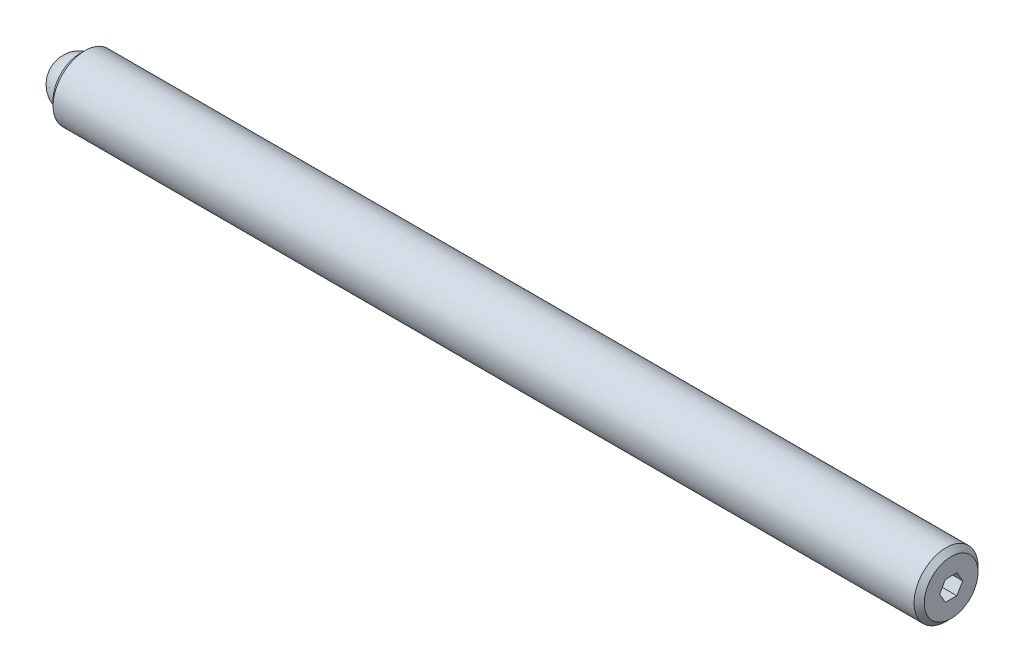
ISO-10303-21;
HEADER;
FILE_DESCRIPTION(('STEP AP214'),'2;1');
FILE_NAME('part.step','',(''),(''),'','','');
FILE_SCHEMA(('AUTOMOTIVE_DESIGN { 1 0 10303 214 1 1 1 1 }'));
ENDSEC;
DATA;
#1=APPLICATION_CONTEXT('core data for automotive mechanical design processes');
#2=APPLICATION_PROTOCOL_DEFINITION('international standard','automotive_design',2000,#1);
#3=PRODUCT_CONTEXT('',#1,'mechanical');
#4=PRODUCT('Part','Part','',(#3));
#5=PRODUCT_RELATED_PRODUCT_CATEGORY('part','',(#4));
#6=PRODUCT_DEFINITION_FORMATION('','',#4);
#7=PRODUCT_DEFINITION_CONTEXT('part definition',#1,'design');
#8=PRODUCT_DEFINITION('design','',#6,#7);
#9=PRODUCT_DEFINITION_SHAPE('','',#8);
#10=(LENGTH_UNIT() NAMED_UNIT(*) SI_UNIT(.MILLI.,.METRE.));
#11=(NAMED_UNIT(*) PLANE_ANGLE_UNIT() SI_UNIT($,.RADIAN.));
#12=(NAMED_UNIT(*) SI_UNIT($,.STERADIAN.) SOLID_ANGLE_UNIT());
#13=UNCERTAINTY_MEASURE_WITH_UNIT(LENGTH_MEASURE(1.E-05),#10,'distance_accuracy_value','');
#14=(GEOMETRIC_REPRESENTATION_CONTEXT(3) GLOBAL_UNCERTAINTY_ASSIGNED_CONTEXT((#13)) GLOBAL_UNIT_ASSIGNED_CONTEXT((#10,
#11,#12)) REPRESENTATION_CONTEXT('',''));
#15=CARTESIAN_POINT('',(0.,0.,0.));
#16=DIRECTION('',(0.,0.,1.));
#17=DIRECTION('',(1.,0.,0.));
#18=AXIS2_PLACEMENT_3D('',#15,#16,#17);
#19=CARTESIAN_POINT('',(0.,0.,0.));
#20=DIRECTION('',(0.,-1.,0.));
#21=DIRECTION('',(0.,0.,1.));
#22=AXIS2_PLACEMENT_3D('',#19,#20,#21);
#23=SPHERICAL_SURFACE('',#22,2.38125);
#24=CARTESIAN_POINT('',(0.,-2.38125,0.));
#25=VERTEX_POINT('',#24);
#26=VERTEX_LOOP('',#25);
#27=FACE_BOUND('',#26,.T.);
#28=ADVANCED_FACE('F43',(#27),#23,.T.);
#29=CLOSED_SHELL('',(#28));
#30=MANIFOLD_SOLID_BREP('B2',#29);
#31=CARTESIAN_POINT('',(86.51875,0.,0.));
#32=DIRECTION('',(-1.,0.,0.));
#33=DIRECTION('',(0.,0.,1.));
#34=AXIS2_PLACEMENT_3D('',#31,#32,#33);
#35=CYLINDRICAL_SURFACE('',#34,3.175);
#36=CARTESIAN_POINT('',(86.01075,0.,0.));
#37=DIRECTION('',(1.,0.,0.));
#38=DIRECTION('',(0.,0.,-1.));
#39=AXIS2_PLACEMENT_3D('',#36,#37,#38);
#40=CIRCLE('',#39,3.175);
#41=CARTESIAN_POINT('',(86.01075,0.,-3.175));
#42=VERTEX_POINT('',#41);
#43=EDGE_CURVE('E41',#42,#42,#40,.F.);
#44=ORIENTED_EDGE('',*,*,#43,.T.);
#45=EDGE_LOOP('',(#44));
#46=FACE_BOUND('',#45,.T.);
#47=CARTESIAN_POINT('',(0.508000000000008,0.,0.));
#48=DIRECTION('',(1.,0.,0.));
#49=DIRECTION('',(0.,0.,-1.));
#50=AXIS2_PLACEMENT_3D('',#47,#48,#49);
#51=CIRCLE('',#50,3.175);
#52=CARTESIAN_POINT('',(0.508000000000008,0.,-3.175));
#53=VERTEX_POINT('',#52);
#54=EDGE_CURVE('E159',#53,#53,#51,.T.);
#55=ORIENTED_EDGE('',*,*,#54,.T.);
#56=EDGE_LOOP('',(#55));
#57=FACE_BOUND('',#56,.T.);
#58=ADVANCED_FACE('F56',(#46,#57),#35,.T.);
#59=CARTESIAN_POINT('',(86.51875,0.,0.));
#60=DIRECTION('',(1.,0.,0.));
#61=DIRECTION('',(0.,0.,-1.));
#62=AXIS2_PLACEMENT_3D('',#59,#60,#61);
#63=PLANE('',#62);
#64=DIRECTION('',(0.,0.866025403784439,-0.5));
#65=VECTOR('',#64,1.);
#66=CARTESIAN_POINT('',(86.51875,-0.9921875,-0.572839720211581));
#67=LINE('',#66,#65);
#68=CARTESIAN_POINT('',(86.51875,-0.9921875,-0.572839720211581));
#69=VERTEX_POINT('',#68);
#70=CARTESIAN_POINT('',(86.51875,0.,-1.14567944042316));
#71=VERTEX_POINT('',#70);
#72=EDGE_CURVE('E71',#69,#71,#67,.T.);
#73=ORIENTED_EDGE('',*,*,#72,.F.);
#74=DIRECTION('',(0.,0.,-1.));
#75=VECTOR('',#74,1.);
#76=CARTESIAN_POINT('',(86.51875,-0.9921875,0.572839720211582));
#77=LINE('',#76,#75);
#78=CARTESIAN_POINT('',(86.51875,-0.9921875,0.572839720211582));
#79=VERTEX_POINT('',#78);
#80=EDGE_CURVE('E155',#79,#69,#77,.T.);
#81=ORIENTED_EDGE('',*,*,#80,.F.);
#82=DIRECTION('',(0.,-0.866025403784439,-0.5));
#83=VECTOR('',#82,1.);
#84=CARTESIAN_POINT('',(86.51875,0.,1.14567944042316));
#85=LINE('',#84,#83);
#86=CARTESIAN_POINT('',(86.51875,0.,1.14567944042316));
#87=VERTEX_POINT('',#86);
#88=EDGE_CURVE('E153',#87,#79,#85,.T.);
#89=ORIENTED_EDGE('',*,*,#88,.F.);
#90=DIRECTION('',(0.,-0.866025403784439,0.5));
#91=VECTOR('',#90,1.);
#92=CARTESIAN_POINT('',(86.51875,0.992187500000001,0.572839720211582));
#93=LINE('',#92,#91);
#94=CARTESIAN_POINT('',(86.51875,0.992187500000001,0.572839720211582));
#95=VERTEX_POINT('',#94);
#96=EDGE_CURVE('E119',#95,#87,#93,.T.);
#97=ORIENTED_EDGE('',*,*,#96,.F.);
#98=DIRECTION('',(0.,0.,1.));
#99=VECTOR('',#98,1.);
#100=CARTESIAN_POINT('',(86.51875,0.9921875,-0.572839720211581));
#101=LINE('',#100,#99);
#102=CARTESIAN_POINT('',(86.51875,0.9921875,-0.572839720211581));
#103=VERTEX_POINT('',#102);
#104=EDGE_CURVE('E149',#103,#95,#101,.T.);
#105=ORIENTED_EDGE('',*,*,#104,.F.);
#106=DIRECTION('',(0.,0.866025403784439,0.5));
#107=VECTOR('',#106,1.);
#108=CARTESIAN_POINT('',(86.51875,0.,-1.14567944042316));
#109=LINE('',#108,#107);
#110=EDGE_CURVE('E145',#71,#103,#109,.T.);
#111=ORIENTED_EDGE('',*,*,#110,.F.);
#112=EDGE_LOOP('',(#73,#81,#89,#97,#105,#111));
#113=FACE_BOUND('',#112,.T.);
#114=CARTESIAN_POINT('',(86.51875,0.,0.));
#115=DIRECTION('',(1.,0.,0.));
#116=DIRECTION('',(0.,0.,-1.));
#117=AXIS2_PLACEMENT_3D('',#114,#115,#116);
#118=CIRCLE('',#117,2.667);
#119=CARTESIAN_POINT('',(86.51875,0.,-2.667));
#120=VERTEX_POINT('',#119);
#121=EDGE_CURVE('E64',#120,#120,#118,.T.);
#122=ORIENTED_EDGE('',*,*,#121,.T.);
#123=EDGE_LOOP('',(#122));
#124=FACE_BOUND('',#123,.T.);
#125=ADVANCED_FACE('F172',(#113,#124),#63,.T.);
#126=CARTESIAN_POINT('',(0.,0.,0.));
#127=DIRECTION('',(1.,0.,0.));
#128=DIRECTION('',(0.,0.,-1.));
#129=AXIS2_PLACEMENT_3D('',#126,#127,#128);
#130=PLANE('',#129);
#131=CARTESIAN_POINT('',(0.,0.,0.));
#132=DIRECTION('',(-1.,0.,0.));
#133=DIRECTION('',(0.,0.,1.));
#134=AXIS2_PLACEMENT_3D('',#131,#132,#133);
#135=CIRCLE('',#134,2.38125);
#136=CARTESIAN_POINT('',(0.,0.,2.38125));
#137=VERTEX_POINT('',#136);
#138=EDGE_CURVE('E227',#137,#137,#135,.T.);
#139=ORIENTED_EDGE('',*,*,#138,.F.);
#140=EDGE_LOOP('',(#139));
#141=FACE_BOUND('',#140,.T.);
#142=CARTESIAN_POINT('',(0.,0.,0.));
#143=DIRECTION('',(1.,0.,0.));
#144=DIRECTION('',(0.,0.,-1.));
#145=AXIS2_PLACEMENT_3D('',#142,#143,#144);
#146=CIRCLE('',#145,2.66699999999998);
#147=CARTESIAN_POINT('',(0.,0.,-2.66699999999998));
#148=VERTEX_POINT('',#147);
#149=EDGE_CURVE('E167',#148,#148,#146,.F.);
#150=ORIENTED_EDGE('',*,*,#149,.T.);
#151=EDGE_LOOP('',(#150));
#152=FACE_BOUND('',#151,.T.);
#153=ADVANCED_FACE('F184',(#141,#152),#130,.F.);
#154=CARTESIAN_POINT('',(0.508000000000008,0.,0.));
#155=DIRECTION('',(1.,0.,0.));
#156=DIRECTION('',(0.,0.,-1.));
#157=AXIS2_PLACEMENT_3D('',#154,#155,#156);
#158=CONICAL_SURFACE('',#157,3.175,0.785398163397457);
#159=ORIENTED_EDGE('',*,*,#149,.F.);
#160=EDGE_LOOP('',(#159));
#161=FACE_BOUND('',#160,.T.);
#162=ORIENTED_EDGE('',*,*,#54,.F.);
#163=EDGE_LOOP('',(#162));
#164=FACE_BOUND('',#163,.T.);
#165=ADVANCED_FACE('F176',(#161,#164),#158,.T.);
#166=CARTESIAN_POINT('',(86.51875,0.,0.));
#167=DIRECTION('',(-1.,0.,0.));
#168=DIRECTION('',(0.,0.,1.));
#169=AXIS2_PLACEMENT_3D('',#166,#167,#168);
#170=CONICAL_SURFACE('',#169,2.667,0.785398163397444);
#171=ORIENTED_EDGE('',*,*,#43,.F.);
#172=EDGE_LOOP('',(#171));
#173=FACE_BOUND('',#172,.T.);
#174=ORIENTED_EDGE('',*,*,#121,.F.);
#175=EDGE_LOOP('',(#174));
#176=FACE_BOUND('',#175,.T.);
#177=ADVANCED_FACE('F58',(#173,#176),#170,.T.);
#178=CARTESIAN_POINT('',(84.23275,-0.9921875,-0.572839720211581));
#179=DIRECTION('',(0.,-0.5,-0.866025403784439));
#180=DIRECTION('',(0.,0.866025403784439,-0.5));
#181=AXIS2_PLACEMENT_3D('',#178,#179,#180);
#182=PLANE('',#181);
#183=ORIENTED_EDGE('',*,*,#72,.T.);
#184=DIRECTION('',(1.,0.,0.));
#185=VECTOR('',#184,1.);
#186=CARTESIAN_POINT('',(84.23275,0.,-1.14567944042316));
#187=LINE('',#186,#185);
#188=CARTESIAN_POINT('',(84.23275,0.,-1.14567944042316));
#189=VERTEX_POINT('',#188);
#190=EDGE_CURVE('E101',#189,#71,#187,.T.);
#191=ORIENTED_EDGE('',*,*,#190,.F.);
#192=DIRECTION('',(0.,0.866025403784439,-0.5));
#193=VECTOR('',#192,1.);
#194=CARTESIAN_POINT('',(84.23275,-0.9921875,-0.572839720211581));
#195=LINE('',#194,#193);
#196=CARTESIAN_POINT('',(84.23275,-0.9921875,-0.572839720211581));
#197=VERTEX_POINT('',#196);
#198=EDGE_CURVE('E157',#197,#189,#195,.T.);
#199=ORIENTED_EDGE('',*,*,#198,.F.);
#200=DIRECTION('',(1.,0.,0.));
#201=VECTOR('',#200,1.);
#202=CARTESIAN_POINT('',(84.23275,-0.9921875,-0.572839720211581));
#203=LINE('',#202,#201);
#204=EDGE_CURVE('E79',#197,#69,#203,.T.);
#205=ORIENTED_EDGE('',*,*,#204,.T.);
#206=EDGE_LOOP('',(#183,#191,#199,#205));
#207=FACE_BOUND('',#206,.T.);
#208=ADVANCED_FACE('F175',(#207),#182,.F.);
#209=CARTESIAN_POINT('',(84.23275,-0.9921875,0.572839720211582));
#210=DIRECTION('',(0.,-1.,0.));
#211=DIRECTION('',(0.,0.,-1.));
#212=AXIS2_PLACEMENT_3D('',#209,#210,#211);
#213=PLANE('',#212);
#214=ORIENTED_EDGE('',*,*,#80,.T.);
#215=ORIENTED_EDGE('',*,*,#204,.F.);
#216=DIRECTION('',(0.,0.,-1.));
#217=VECTOR('',#216,1.);
#218=CARTESIAN_POINT('',(84.23275,-0.9921875,0.572839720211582));
#219=LINE('',#218,#217);
#220=CARTESIAN_POINT('',(84.23275,-0.9921875,0.572839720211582));
#221=VERTEX_POINT('',#220);
#222=EDGE_CURVE('E131',#221,#197,#219,.T.);
#223=ORIENTED_EDGE('',*,*,#222,.F.);
#224=DIRECTION('',(1.,0.,0.));
#225=VECTOR('',#224,1.);
#226=CARTESIAN_POINT('',(84.23275,-0.9921875,0.572839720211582));
#227=LINE('',#226,#225);
#228=EDGE_CURVE('E123',#221,#79,#227,.T.);
#229=ORIENTED_EDGE('',*,*,#228,.T.);
#230=EDGE_LOOP('',(#214,#215,#223,#229));
#231=FACE_BOUND('',#230,.T.);
#232=ADVANCED_FACE('F182',(#231),#213,.F.);
#233=CARTESIAN_POINT('',(84.23275,0.,1.14567944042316));
#234=DIRECTION('',(0.,-0.5,0.866025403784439));
#235=DIRECTION('',(0.,-0.866025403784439,-0.5));
#236=AXIS2_PLACEMENT_3D('',#233,#234,#235);
#237=PLANE('',#236);
#238=ORIENTED_EDGE('',*,*,#88,.T.);
#239=ORIENTED_EDGE('',*,*,#228,.F.);
#240=DIRECTION('',(0.,-0.866025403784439,-0.5));
#241=VECTOR('',#240,1.);
#242=CARTESIAN_POINT('',(84.23275,0.,1.14567944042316));
#243=LINE('',#242,#241);
#244=CARTESIAN_POINT('',(84.23275,0.,1.14567944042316));
#245=VERTEX_POINT('',#244);
#246=EDGE_CURVE('E127',#245,#221,#243,.T.);
#247=ORIENTED_EDGE('',*,*,#246,.F.);
#248=DIRECTION('',(1.,0.,0.));
#249=VECTOR('',#248,1.);
#250=CARTESIAN_POINT('',(84.23275,0.,1.14567944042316));
#251=LINE('',#250,#249);
#252=EDGE_CURVE('E112',#245,#87,#251,.T.);
#253=ORIENTED_EDGE('',*,*,#252,.T.);
#254=EDGE_LOOP('',(#238,#239,#247,#253));
#255=FACE_BOUND('',#254,.T.);
#256=ADVANCED_FACE('F128',(#255),#237,.F.);
#257=CARTESIAN_POINT('',(84.23275,0.992187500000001,0.572839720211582));
#258=DIRECTION('',(0.,0.5,0.866025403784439));
#259=DIRECTION('',(0.,-0.866025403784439,0.5));
#260=AXIS2_PLACEMENT_3D('',#257,#258,#259);
#261=PLANE('',#260);
#262=ORIENTED_EDGE('',*,*,#96,.T.);
#263=ORIENTED_EDGE('',*,*,#252,.F.);
#264=DIRECTION('',(0.,-0.866025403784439,0.5));
#265=VECTOR('',#264,1.);
#266=CARTESIAN_POINT('',(84.23275,0.992187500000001,0.572839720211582));
#267=LINE('',#266,#265);
#268=CARTESIAN_POINT('',(84.23275,0.992187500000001,0.572839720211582));
#269=VERTEX_POINT('',#268);
#270=EDGE_CURVE('E116',#269,#245,#267,.T.);
#271=ORIENTED_EDGE('',*,*,#270,.F.);
#272=DIRECTION('',(1.,0.,0.));
#273=VECTOR('',#272,1.);
#274=CARTESIAN_POINT('',(84.23275,0.992187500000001,0.572839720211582));
#275=LINE('',#274,#273);
#276=EDGE_CURVE('E124',#269,#95,#275,.T.);
#277=ORIENTED_EDGE('',*,*,#276,.T.);
#278=EDGE_LOOP('',(#262,#263,#271,#277));
#279=FACE_BOUND('',#278,.T.);
#280=ADVANCED_FACE('F114',(#279),#261,.F.);
#281=CARTESIAN_POINT('',(84.23275,0.9921875,-0.572839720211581));
#282=DIRECTION('',(0.,1.,0.));
#283=DIRECTION('',(0.,0.,1.));
#284=AXIS2_PLACEMENT_3D('',#281,#282,#283);
#285=PLANE('',#284);
#286=ORIENTED_EDGE('',*,*,#104,.T.);
#287=ORIENTED_EDGE('',*,*,#276,.F.);
#288=DIRECTION('',(0.,0.,1.));
#289=VECTOR('',#288,1.);
#290=CARTESIAN_POINT('',(84.23275,0.9921875,-0.572839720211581));
#291=LINE('',#290,#289);
#292=CARTESIAN_POINT('',(84.23275,0.9921875,-0.572839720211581));
#293=VERTEX_POINT('',#292);
#294=EDGE_CURVE('E137',#293,#269,#291,.T.);
#295=ORIENTED_EDGE('',*,*,#294,.F.);
#296=DIRECTION('',(1.,0.,0.));
#297=VECTOR('',#296,1.);
#298=CARTESIAN_POINT('',(84.23275,0.9921875,-0.572839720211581));
#299=LINE('',#298,#297);
#300=EDGE_CURVE('E162',#293,#103,#299,.T.);
#301=ORIENTED_EDGE('',*,*,#300,.T.);
#302=EDGE_LOOP('',(#286,#287,#295,#301));
#303=FACE_BOUND('',#302,.T.);
#304=ADVANCED_FACE('F203',(#303),#285,.F.);
#305=CARTESIAN_POINT('',(84.23275,0.,-1.14567944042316));
#306=DIRECTION('',(0.,0.5,-0.866025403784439));
#307=DIRECTION('',(0.,0.866025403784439,0.5));
#308=AXIS2_PLACEMENT_3D('',#305,#306,#307);
#309=PLANE('',#308);
#310=ORIENTED_EDGE('',*,*,#110,.T.);
#311=ORIENTED_EDGE('',*,*,#300,.F.);
#312=DIRECTION('',(0.,0.866025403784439,0.5));
#313=VECTOR('',#312,1.);
#314=CARTESIAN_POINT('',(84.23275,0.,-1.14567944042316));
#315=LINE('',#314,#313);
#316=EDGE_CURVE('E139',#189,#293,#315,.T.);
#317=ORIENTED_EDGE('',*,*,#316,.F.);
#318=ORIENTED_EDGE('',*,*,#190,.T.);
#319=EDGE_LOOP('',(#310,#311,#317,#318));
#320=FACE_BOUND('',#319,.T.);
#321=ADVANCED_FACE('F200',(#320),#309,.F.);
#322=CARTESIAN_POINT('',(84.23275,0.,0.));
#323=DIRECTION('',(1.,0.,0.));
#324=DIRECTION('',(0.,0.,-1.));
#325=AXIS2_PLACEMENT_3D('',#322,#323,#324);
#326=PLANE('',#325);
#327=ORIENTED_EDGE('',*,*,#198,.T.);
#328=ORIENTED_EDGE('',*,*,#316,.T.);
#329=ORIENTED_EDGE('',*,*,#294,.T.);
#330=ORIENTED_EDGE('',*,*,#270,.T.);
#331=ORIENTED_EDGE('',*,*,#246,.T.);
#332=ORIENTED_EDGE('',*,*,#222,.T.);
#333=EDGE_LOOP('',(#327,#328,#329,#330,#331,#332));
#334=FACE_BOUND('',#333,.T.);
#335=ADVANCED_FACE('F134',(#334),#326,.T.);
#336=CARTESIAN_POINT('',(1.984375,0.,0.));
#337=DIRECTION('',(-1.,0.,0.));
#338=DIRECTION('',(0.,0.,1.));
#339=AXIS2_PLACEMENT_3D('',#336,#337,#338);
#340=CYLINDRICAL_SURFACE('',#339,2.38125);
#341=CARTESIAN_POINT('',(1.984375,0.,0.));
#342=DIRECTION('',(-1.,0.,0.));
#343=DIRECTION('',(0.,0.,1.));
#344=AXIS2_PLACEMENT_3D('',#341,#342,#343);
#345=CIRCLE('',#344,2.38125);
#346=CARTESIAN_POINT('',(1.984375,0.,2.38125));
#347=VERTEX_POINT('',#346);
#348=EDGE_CURVE('E146',#347,#347,#345,.T.);
#349=ORIENTED_EDGE('',*,*,#348,.F.);
#350=EDGE_LOOP('',(#349));
#351=FACE_BOUND('',#350,.T.);
#352=ORIENTED_EDGE('',*,*,#138,.T.);
#353=EDGE_LOOP('',(#352));
#354=FACE_BOUND('',#353,.T.);
#355=ADVANCED_FACE('F216',(#351,#354),#340,.F.);
#356=CARTESIAN_POINT('',(1.984375,0.,0.));
#357=DIRECTION('',(-1.,0.,0.));
#358=DIRECTION('',(0.,0.,1.));
#359=AXIS2_PLACEMENT_3D('',#356,#357,#358);
#360=PLANE('',#359);
#361=ORIENTED_EDGE('',*,*,#348,.T.);
#362=EDGE_LOOP('',(#361));
#363=FACE_BOUND('',#362,.T.);
#364=ADVANCED_FACE('F219',(#363),#360,.T.);
#365=CLOSED_SHELL('',(#58,#125,#153,#165,#177,#208,#232,#256,#280,#304,#321,#335,#355,#364));
#366=MANIFOLD_SOLID_BREP('B6',#365);
#367=ADVANCED_BREP_SHAPE_REPRESENTATION('',(#18,#30,#366),#14);
#368=SHAPE_DEFINITION_REPRESENTATION(#9,#367);
ENDSEC;
END-ISO-10303-21;
